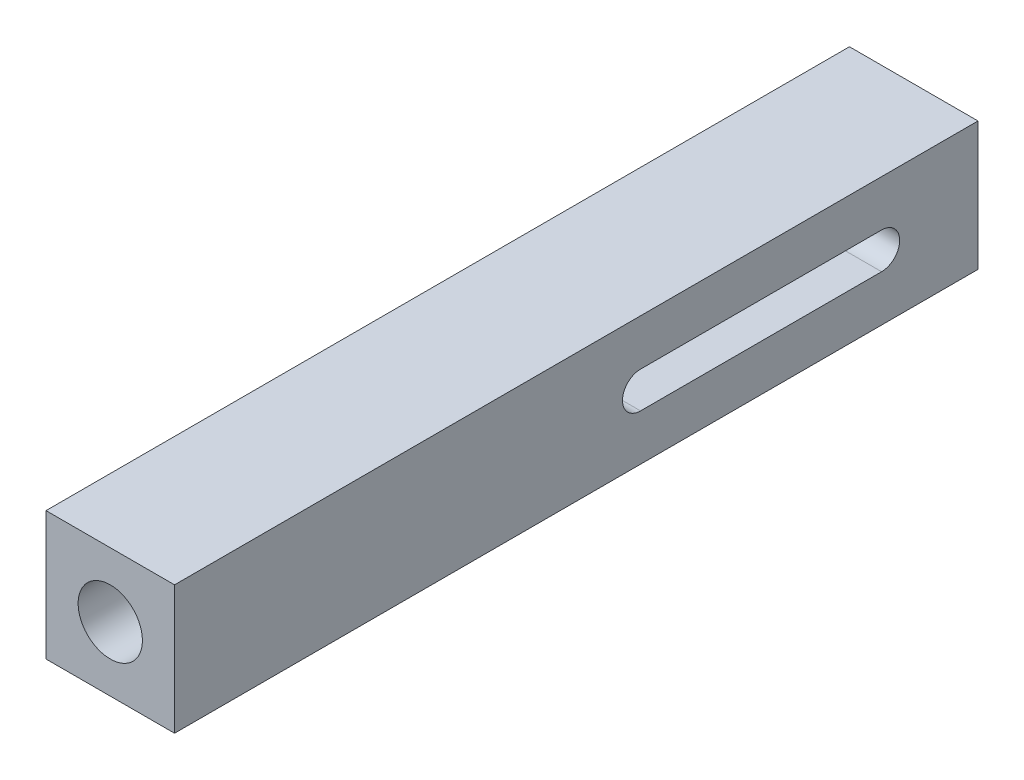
from build123d import *

# Parameters (mm, degrees)
SKETCH1_W           = 16
SKETCH1_H           = 16
SKETCH1_R           = 4
BOSS_EXTRUDE1_DEPTH = 100
CUT_EXTRUDE1_DEPTH  = 102.587400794


with BuildPart() as part:
    # Sketch1 → Boss-Extrude1 (new body)
    with BuildSketch(Plane.XY):
        Rectangle(SKETCH1_W, SKETCH1_H)
        Circle(SKETCH1_R, mode=Mode.SUBTRACT)
    extrude(amount=BOSS_EXTRUDE1_DEPTH)

    # Sketch2 → Cut-Extrude1 (cut, through all)
    with BuildSketch(Plane(origin=(8, 0, 0), x_dir=(0, 0, -1), z_dir=(1, 0, 0))):
        with BuildLine():
            Line((-42, 2.25), (-12, 2.25))
            ThreePointArc((-12, 2.25), (-9.75, 0), (-12, -2.25))
            Line((-12, -2.25), (-42, -2.25))
            ThreePointArc((-42, -2.25), (-44.25, 0), (-42, 2.25))
        make_face()
    extrude(amount=-CUT_EXTRUDE1_DEPTH, mode=Mode.SUBTRACT)


solid = part.part
